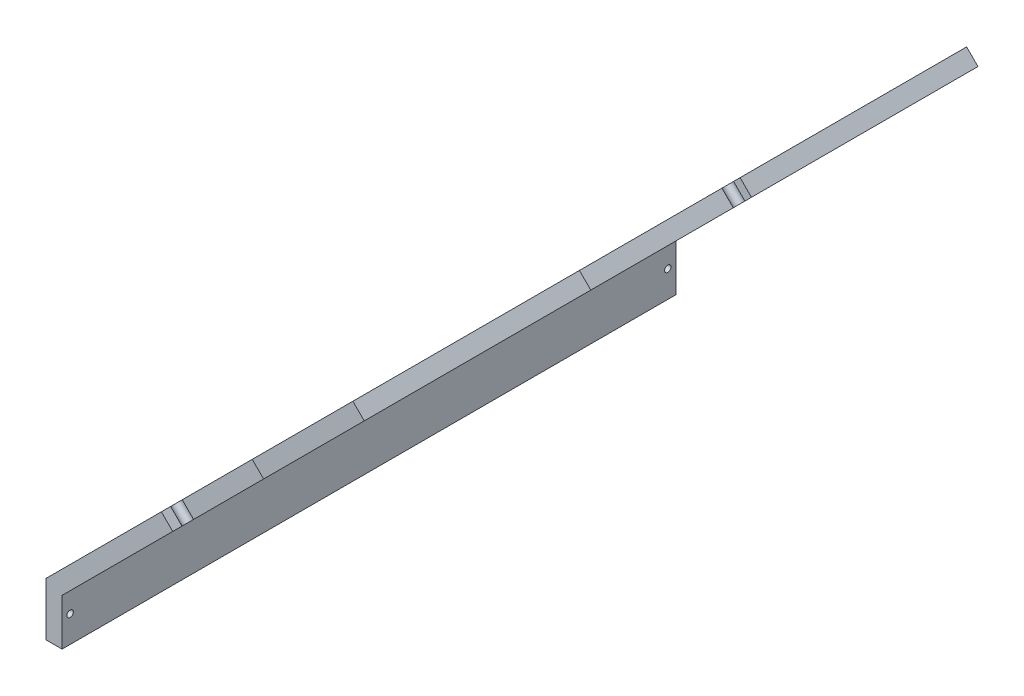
from build123d import *

# Parameters (mm, degrees)
BOSS_EXTRU_1_DEPTH      = 191
ESQUISSE2_R             = 1
ENL_V_MAT_EXTRU_1_DEPTH = 5
ESQUISSE4_R             = 1
ENL_V_MAT_EXTRU_2_DEPTH = 10


with BuildPart() as part:
    # Esquisse1 → Boss.-Extru.1 (new body)
    with BuildSketch(Plane.XY):
        Polygon((0, 0), (-5, 0), (-5, 16.571067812), (90.502596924, 112.073664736), (94.03813083, 108.53813083), (0, 14.5), align=None)
    extrude(amount=BOSS_EXTRU_1_DEPTH)

    # Esquisse2 → Enl_v. mat.-Extru.1 (cut)
    with BuildSketch(Plane(origin=(-10.785533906, 10.785533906, 0), x_dir=(0, 0, 1), z_dir=(-0.7071067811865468, 0.7071067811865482, 0))):
        with Locations(Location((35.119684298, 140.605985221, 0), (0, 0, 270))):
            Circle(ESQUISSE2_R)
        with Locations(Location((2.5, 121.094765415, 0), (0, 0, 270))):
            Circle(ESQUISSE2_R)
        with Locations(Location((155.75, 140.741212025, 0), (0, 0, 270))):
            Circle(ESQUISSE2_R)
        with Locations(Location((188.5, 121.094765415, 0), (0, 0, 270))):
            Circle(ESQUISSE2_R)
        with Locations(Location((188.5, 33.564231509, 0), (0, 0, 270))):
            Circle(ESQUISSE2_R)
        with Locations(Location((2.5, 33.564231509, 0), (0, 0, 270))):
            Circle(ESQUISSE2_R)
        with BuildLine():
            Line((2.878679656, 98.946482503), (0, 98.946482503))
            Line((0, 98.946482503), (0, 58.946482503))
            Line((0, 58.946482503), (2.878679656, 58.946482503))
            ThreePointArc((2.878679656, 58.946482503), (5, 58.946482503), (5, 61.067802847))
            Line((5, 61.067802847), (5, 96.82516216))
            ThreePointArc((5, 96.82516216), (5, 98.946482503), (2.878679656, 98.946482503))
        make_face()
        with BuildLine():
            Line((72.621320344, 138.239375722), (118.378679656, 138.239375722))
            ThreePointArc((118.378679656, 138.239375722), (120.5, 138.239375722), (120.5, 140.360696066))
            Line((120.5, 140.360696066), (120.5, 143.243048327))
            Line((120.5, 143.243048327), (70.5, 143.243048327))
            Line((70.5, 143.243048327), (70.5, 140.360696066))
            ThreePointArc((70.5, 140.360696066), (70.5, 138.239375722), (72.621320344, 138.239375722))
        make_face()
        with BuildLine():
            Line((191, 98.946482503), (188.121320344, 98.946482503))
            ThreePointArc((188.121320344, 98.946482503), (186, 98.946482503), (186, 96.82516216))
            Line((186, 96.82516216), (186, 61.067802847))
            ThreePointArc((186, 61.067802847), (186, 58.946482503), (188.121320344, 58.946482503))
            Line((188.121320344, 58.946482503), (191, 58.946482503))
            Line((191, 58.946482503), (191, 98.946482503))
        make_face()
    extrude(amount=-ENL_V_MAT_EXTRU_1_DEPTH, mode=Mode.SUBTRACT)

    # Esquisse4 → Enl_v. mat.-Extru.2 (cut)
    with BuildSketch(Plane.ZY.offset(5)):
        with Locations(Location((2.5, 8.285533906, 0), (0, 0, 270))):
            Circle(ESQUISSE4_R)
        with Locations(Location((188.5, 8.285533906, 0), (0, 0, 270))):
            Circle(ESQUISSE4_R)
    extrude(amount=-ENL_V_MAT_EXTRU_2_DEPTH, mode=Mode.SUBTRACT)


solid = part.part
